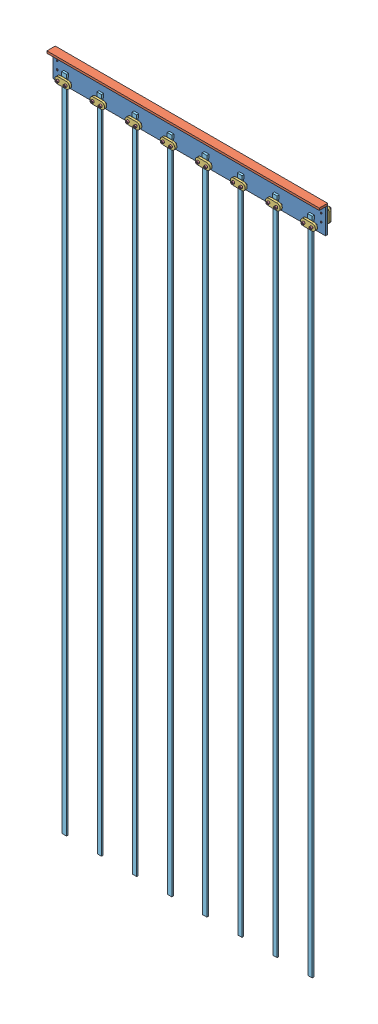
SolidWorks assembly fs-ua-right-mount-assembly-with-led-strips.SLDASM, configuration Default (file format 9000). Lengths in mm.
Overall size (825.5 2044.33 45.12).
42 component instances, 5 part files, 0 mates.
Components (placement in the parent):
- fs-ua-right-mount-assembly-with-screws-1: fs-ua-right-mount-assembly-with-screws.SLDASM [Default] at origin size (825.5 82.55 45.12)
  - fs-ua-right-mount-assembly-1: fs-ua-right-mount-assembly.SLDASM [Default] at origin size (825.5 82.55 38.15)
    - fs-ua-right-mount-vertical-component-1: fs-ua-right-mount-vertical-component.SLDPRT [Default] at origin size (825.5 76.2 6.35)
    - fs-ua-right-mount-horizontal-component-1: fs-ua-right-mount-horizontal-component.SLDPRT [Default] at (412.75 76.2 12.7) size (825.5 6.35 25.4)
    - fs-clamp-1: fs-clamp.SLDPRT [Default] at (27.94 15.24 12.7326) size (44.45 20.32 6.35)
    - fs-clamp-11: fs-clamp.SLDPRT [Default] at (12.7 29.845 -12.7409) x (0 1 0) z (0 0 1) size (44.45 20.32 6.35)
    - fs-clamp-12: fs-clamp.SLDPRT [Default] at (812.8 29.845 -6.3972) x (0 1 0) z (0 0 -1) size (44.45 20.32 6.35)
    - fs-clamp-4: fs-clamp.SLDPRT [Default] at (134.366 15.24 12.7326) size (44.45 20.32 6.35)
    - fs-clamp-5: fs-clamp.SLDPRT [Default] at (240.792 15.24 12.7326) size (44.45 20.32 6.35)
    - fs-clamp-6: fs-clamp.SLDPRT [Default] at (347.218 15.24 12.7326) size (44.45 20.32 6.35)
    - fs-clamp-7: fs-clamp.SLDPRT [Default] at (453.644 15.24 12.7326) size (44.45 20.32 6.35)
    - fs-clamp-8: fs-clamp.SLDPRT [Default] at (560.07 15.24 12.7326) size (44.45 20.32 6.35)
    - fs-clamp-9: fs-clamp.SLDPRT [Default] at (666.496 15.24 12.7326) size (44.45 20.32 6.35)
    - fs-clamp-10: fs-clamp.SLDPRT [Default] at (772.922 15.24 12.7326) size (44.45 20.32 6.35)
  - socket head cap screw_ai-1: socket head cap screw_ai.sldprt [HX-SHCS 0.19-32x0.875x0.875-N] at (52.07 15.24 25.3347) x (0 0 -1) z (0.61191 -0.790927 0) size (27.05 7.94 7.94)
  - socket head cap screw_ai-2: socket head cap screw_ai.sldprt [HX-SHCS 0.19-32x0.875x0.875-N] at (12.7 29.845 -19.6757) x (0 0 1) z (-0.841681 -0.539975 0) size (27.05 7.94 7.94)
  - socket head cap screw_ai-3: socket head cap screw_ai.sldprt [HX-SHCS 0.19-32x0.875x0.875-N] at (12.7 53.975 -19.387) x (0 0 1) z (0.231262 0.972891 0) size (27.05 7.94 7.94)
  - socket head cap screw_ai-4: socket head cap screw_ai.sldprt [HX-SHCS 0.19-32x0.875x0.875-N] at (812.8 29.845 -19.7235) x (0 0 1) z (-0.178736 -0.983897 0) size (27.05 7.94 7.94)
  - socket head cap screw_ai-5: socket head cap screw_ai.sldprt [HX-SHCS 0.19-32x0.875x0.875-N] at (812.8 53.975 -19.4006) x (0 0 1) z (-0.954871 -0.29702 0) size (27.05 7.94 7.94)
  - socket head cap screw_ai-6: socket head cap screw_ai.sldprt [HX-SHCS 0.19-32x0.875x0.875-N] at (27.94 15.24 25.0524) x (0 0 -1) z (-0.570283 0.821448 0) size (27.05 7.94 7.94)
  - socket head cap screw_ai-7: socket head cap screw_ai.sldprt [HX-SHCS 0.19-32x0.875x0.875-N] at (134.366 15.24 25.0524) x (0 0 -1) z (-0.570283 0.821448 0) size (27.05 7.94 7.94)
  - socket head cap screw_ai-8: socket head cap screw_ai.sldprt [HX-SHCS 0.19-32x0.875x0.875-N] at (240.792 15.24 25.0524) x (0 0 -1) z (-0.570283 0.821448 0) size (27.05 7.94 7.94)
  - socket head cap screw_ai-9: socket head cap screw_ai.sldprt [HX-SHCS 0.19-32x0.875x0.875-N] at (347.218 15.24 25.0524) x (0 0 -1) z (-0.570283 0.821448 0) size (27.05 7.94 7.94)
  - socket head cap screw_ai-10: socket head cap screw_ai.sldprt [HX-SHCS 0.19-32x0.875x0.875-N] at (453.644 15.24 25.0524) x (0 0 -1) z (-0.570283 0.821448 0) size (27.05 7.94 7.94)
  - socket head cap screw_ai-11: socket head cap screw_ai.sldprt [HX-SHCS 0.19-32x0.875x0.875-N] at (560.07 15.24 25.0524) x (0 0 -1) z (-0.570283 0.821448 0) size (27.05 7.94 7.94)
  - socket head cap screw_ai-12: socket head cap screw_ai.sldprt [HX-SHCS 0.19-32x0.875x0.875-N] at (666.496 15.24 25.0524) x (0 0 -1) z (-0.570283 0.821448 0) size (27.05 7.94 7.94)
  - socket head cap screw_ai-13: socket head cap screw_ai.sldprt [HX-SHCS 0.19-32x0.875x0.875-N] at (772.922 15.24 25.0524) x (0 0 -1) z (-0.570283 0.821448 0) size (27.05 7.94 7.94)
  - socket head cap screw_ai-14: socket head cap screw_ai.sldprt [HX-SHCS 0.19-32x0.875x0.875-N] at (158.496 15.24 25.3347) x (0 0 -1) z (0.61191 -0.790927 0) size (27.05 7.94 7.94)
  - socket head cap screw_ai-15: socket head cap screw_ai.sldprt [HX-SHCS 0.19-32x0.875x0.875-N] at (264.922 15.24 25.3347) x (0 0 -1) z (0.61191 -0.790927 0) size (27.05 7.94 7.94)
  - socket head cap screw_ai-16: socket head cap screw_ai.sldprt [HX-SHCS 0.19-32x0.875x0.875-N] at (371.348 15.24 25.3347) x (0 0 -1) z (0.61191 -0.790927 0) size (27.05 7.94 7.94)
  - socket head cap screw_ai-17: socket head cap screw_ai.sldprt [HX-SHCS 0.19-32x0.875x0.875-N] at (477.774 15.24 25.3347) x (0 0 -1) z (0.61191 -0.790927 0) size (27.05 7.94 7.94)
  - socket head cap screw_ai-18: socket head cap screw_ai.sldprt [HX-SHCS 0.19-32x0.875x0.875-N] at (584.2 15.24 25.3347) x (0 0 -1) z (0.61191 -0.790927 0) size (27.05 7.94 7.94)
  - socket head cap screw_ai-19: socket head cap screw_ai.sldprt [HX-SHCS 0.19-32x0.875x0.875-N] at (690.626 15.24 25.3347) x (0 0 -1) z (0.61191 -0.790927 0) size (27.05 7.94 7.94)
  - socket head cap screw_ai-20: socket head cap screw_ai.sldprt [HX-SHCS 0.19-32x0.875x0.875-N] at (797.052 15.24 25.3347) x (0 0 -1) z (0.61191 -0.790927 0) size (27.05 7.94 7.94)
- fs-led-strip-1: fs-led-strip.SLDPRT [Default] at (39.8281 32.6608 10.0075) size (14.29 2000 6.35)
- fs-led-strip-2: fs-led-strip.SLDPRT [Default] at (146.2541 32.6608 10.0075) size (14.29 2000 6.35)
- fs-led-strip-3: fs-led-strip.SLDPRT [Default] at (252.6801 32.6608 10.0075) size (14.29 2000 6.35)
- fs-led-strip-4: fs-led-strip.SLDPRT [Default] at (359.1061 32.6608 10.0075) size (14.29 2000 6.35)
- fs-led-strip-5: fs-led-strip.SLDPRT [Default] at (465.5321 32.6608 10.0075) size (14.29 2000 6.35)
- fs-led-strip-6: fs-led-strip.SLDPRT [Default] at (571.9581 32.6608 10.0075) size (14.29 2000 6.35)
- fs-led-strip-7: fs-led-strip.SLDPRT [Default] at (678.3841 32.6608 10.0075) size (14.29 2000 6.35)
- fs-led-strip-8: fs-led-strip.SLDPRT [Default] at (784.8101 32.6608 10.0075) size (14.29 2000 6.35)
